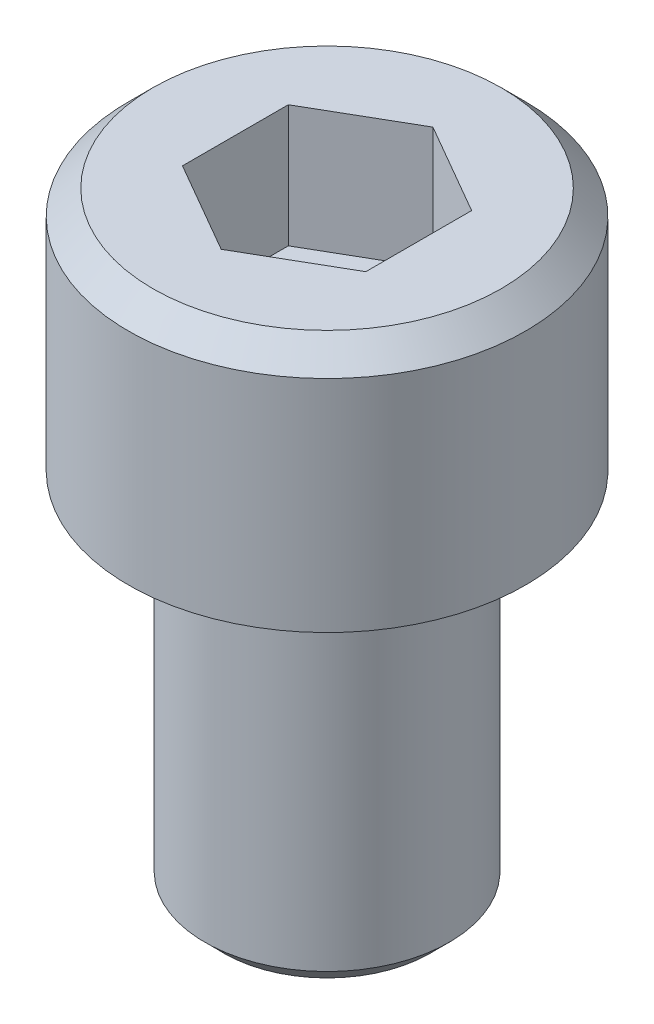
from build123d import *

# Parameters (mm, degrees)
CUT_EXTRUDE1_DEPTH = 4
CHAMFER1_SIZE      = 0.625


with BuildPart() as part:
    # Sketch1 → Revolve1 (revolve)
    with BuildSketch(Plane.XY, mode=Mode.PRIVATE) as revolve1_sk:
        Polygon((0, 20), (5.7, 20), (6.5, 19.2), (6.5, 12), (4, 12), (4, 0), (0, 0), align=None)
    revolve(revolve1_sk.sketch.rotate(Axis((0, 0, 0), (0, 1, 0)), 90), axis=Axis((0, 0, 0), (0, 1, 0)))

    # Sketch2 → Cut-Extrude1 (cut)
    with BuildSketch(Plane.ZX.offset(20)):
        Polygon((-1.732050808, 3), (-3.464101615, 0), (-1.732050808, -3), (1.732050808, -3), (3.464101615, 0), (1.732050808, 3), align=None)
    extrude(amount=-CUT_EXTRUDE1_DEPTH, mode=Mode.SUBTRACT)

    # Chamfer1
    chamfer1_edges = [part.edges().sort_by_distance(p)[0] for p in [
        (0, 0, 4),
    ]]
    chamfer(chamfer1_edges, length=CHAMFER1_SIZE)


solid = part.part
